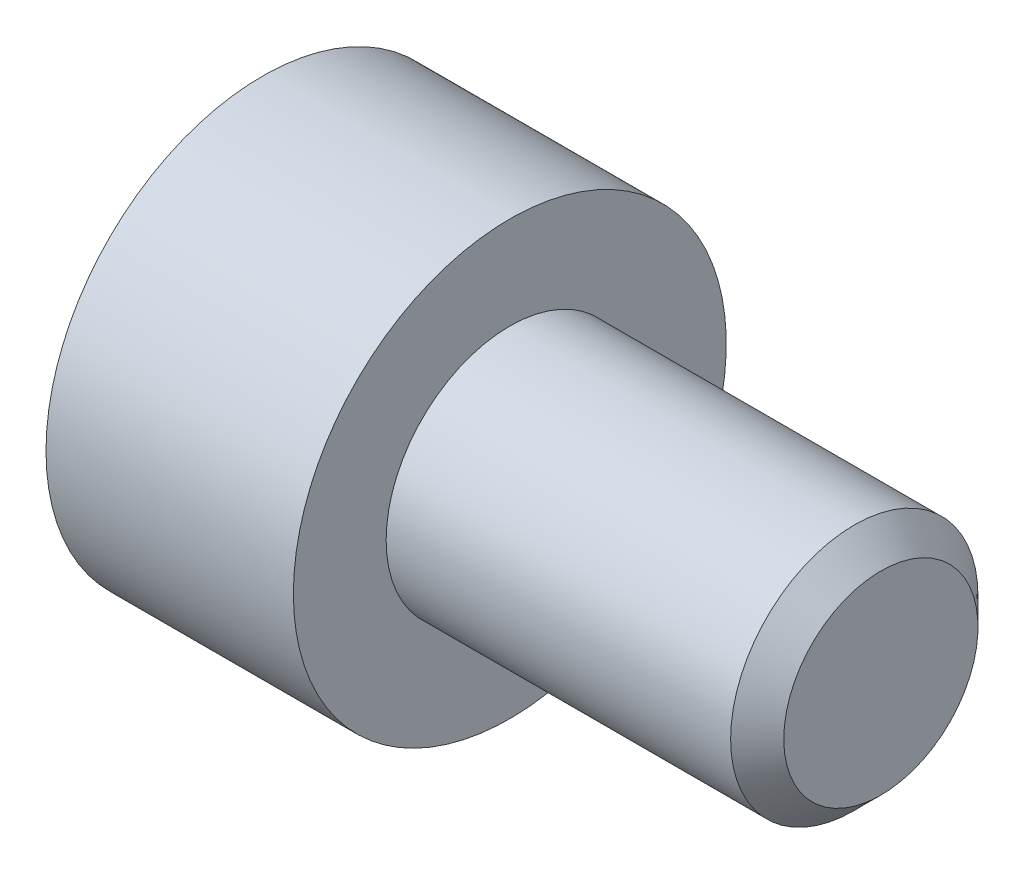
from build123d import *

# Parameters (mm, degrees)
ENL_V_MAT_EXTRU_1_DEPTH = 2


with BuildPart() as part:
    # Esquisse1 → R_volution1 (revolve)
    with BuildSketch(Plane.XY, mode=Mode.PRIVATE) as r_volution1_sk:
        Polygon((-4, 0), (-4, 3.5), (0, 3.5), (0, 2), (5.5705, 2), (6, 1.5705), (6, 0), align=None)
    revolve(r_volution1_sk.sketch.rotate(Axis((6, 0, 0), (-1, 0, 0)), 270), axis=Axis((6, 0, 0), (-1, 0, 0)))

    # Esquisse2 → Enl_v. mat.-Extru.1 (cut)
    with BuildSketch(Plane(origin=(-4, 0, 0), x_dir=(0, 0, -1), z_dir=(1, 0, 0))):
        Polygon((-1.5, 0.866025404), (-1.5, -0.866025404), (0, -1.732050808), (1.5, -0.866025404), (1.5, 0.866025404), (0, 1.732050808), align=None)
    extrude(amount=ENL_V_MAT_EXTRU_1_DEPTH, mode=Mode.SUBTRACT)

    # Esquisse3 → Enl_vement de mati_re-R_volution1 (revolve, cut)
    with BuildSketch(Plane.XY, mode=Mode.PRIVATE) as enl_vement_de_mati_re_r_volution1_sk:
        Polygon((-2, 0), (-2, 1.49), (-1.139748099, 0), align=None)
    revolve(enl_vement_de_mati_re_r_volution1_sk.sketch.rotate(Axis((-1.139748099, 0, 0), (-1, 0, 0)), 270), axis=Axis((-1.139748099, 0, 0), (-1, 0, 0)), mode=Mode.SUBTRACT)


solid = part.part
